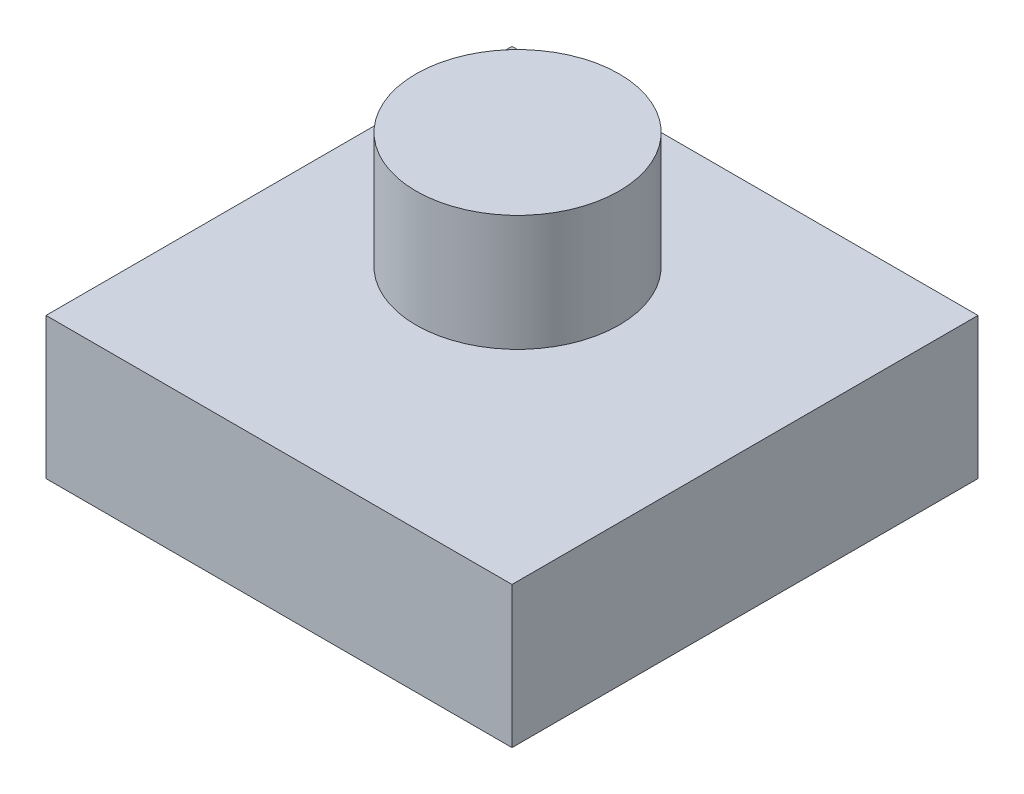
from build123d import *

# Parameters (mm, degrees)
SKETCH1_W      = 97.52724138
SKETCH1_H      = 97.52724138
EXTRUDE1_DEPTH = 29.577471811
SKETCH2_R      = 21.253591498
EXTRUDE2_DEPTH = 24.290520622


with BuildPart() as part:
    # Sketch1 → Extrude1 (new body)
    with BuildSketch(Plane(origin=(0, 0, 0), x_dir=(1, 0, 0), z_dir=(0, 1, 0))):
        Rectangle(SKETCH1_W, SKETCH1_H)
    extrude(amount=EXTRUDE1_DEPTH)

    # Sketch2 → Extrude2 (add)
    with BuildSketch(Plane(origin=(0, 29.577471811, 0), x_dir=(-1, 0, 0), z_dir=(0, 1, 0))):
        with Locations(Location((8.283257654, -9.452987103, 0), (0, 0, 90))):
            Circle(SKETCH2_R)
    extrude(amount=EXTRUDE2_DEPTH)


solid = part.part
